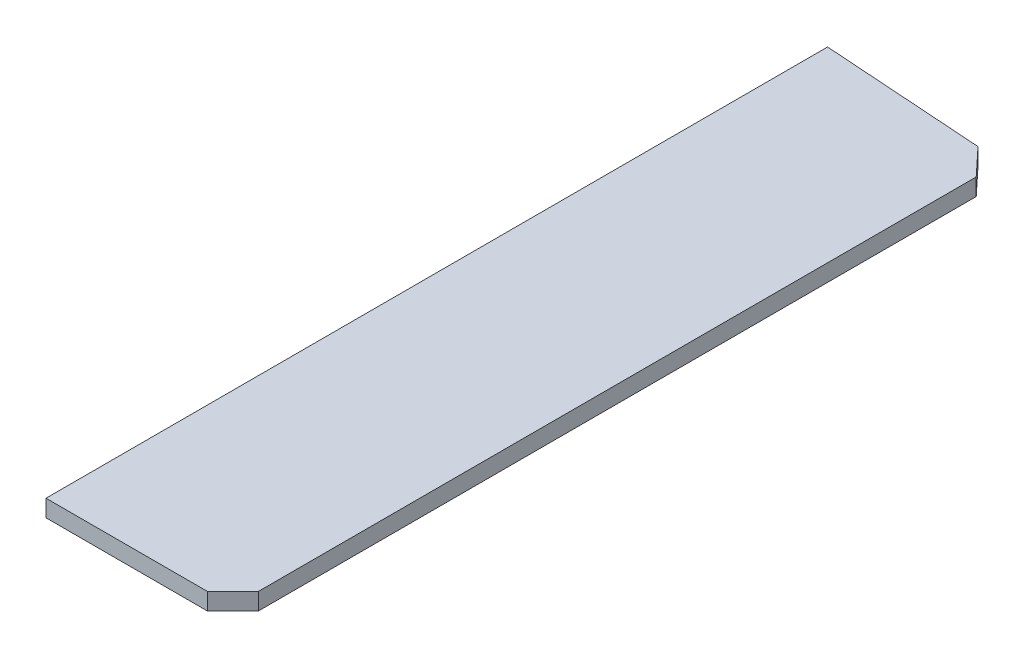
ISO-10303-21;
HEADER;
FILE_DESCRIPTION(('STEP AP214'),'2;1');
FILE_NAME('part.step','',(''),(''),'','','');
FILE_SCHEMA(('AUTOMOTIVE_DESIGN { 1 0 10303 214 1 1 1 1 }'));
ENDSEC;
DATA;
#1=APPLICATION_CONTEXT('core data for automotive mechanical design processes');
#2=APPLICATION_PROTOCOL_DEFINITION('international standard','automotive_design',2000,#1);
#3=PRODUCT_CONTEXT('',#1,'mechanical');
#4=PRODUCT('Part','Part','',(#3));
#5=PRODUCT_RELATED_PRODUCT_CATEGORY('part','',(#4));
#6=PRODUCT_DEFINITION_FORMATION('','',#4);
#7=PRODUCT_DEFINITION_CONTEXT('part definition',#1,'design');
#8=PRODUCT_DEFINITION('design','',#6,#7);
#9=PRODUCT_DEFINITION_SHAPE('','',#8);
#10=(LENGTH_UNIT() NAMED_UNIT(*) SI_UNIT(.MILLI.,.METRE.));
#11=(NAMED_UNIT(*) PLANE_ANGLE_UNIT() SI_UNIT($,.RADIAN.));
#12=(NAMED_UNIT(*) SI_UNIT($,.STERADIAN.) SOLID_ANGLE_UNIT());
#13=UNCERTAINTY_MEASURE_WITH_UNIT(LENGTH_MEASURE(1.E-05),#10,'distance_accuracy_value','');
#14=(GEOMETRIC_REPRESENTATION_CONTEXT(3) GLOBAL_UNCERTAINTY_ASSIGNED_CONTEXT((#13)) GLOBAL_UNIT_ASSIGNED_CONTEXT((#10,
#11,#12)) REPRESENTATION_CONTEXT('',''));
#15=CARTESIAN_POINT('',(0.,0.,0.));
#16=DIRECTION('',(0.,0.,1.));
#17=DIRECTION('',(1.,0.,0.));
#18=AXIS2_PLACEMENT_3D('',#15,#16,#17);
#19=CARTESIAN_POINT('',(60.3470628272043,6.34999999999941,-287.985427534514));
#20=DIRECTION('',(-0.73076120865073,0.,0.68263317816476));
#21=DIRECTION('',(0.682633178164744,0.,0.73076120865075));
#22=AXIS2_PLACEMENT_3D('',#19,#20,#21);
#23=PLANE('',#22);
#24=DIRECTION('',(-0.682633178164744,0.,-0.730761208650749));
#25=VECTOR('',#24,1.);
#26=CARTESIAN_POINT('',(60.3470628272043,0.,-287.985427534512));
#27=LINE('',#26,#25);
#28=CARTESIAN_POINT('',(69.85,0.,-277.812500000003));
#29=VERTEX_POINT('',#28);
#30=CARTESIAN_POINT('',(60.3470628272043,0.,-287.985427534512));
#31=VERTEX_POINT('',#30);
#32=EDGE_CURVE('E116',#29,#31,#27,.T.);
#33=ORIENTED_EDGE('',*,*,#32,.T.);
#34=DIRECTION('',(0.,-1.00000000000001,0.));
#35=VECTOR('',#34,1.);
#36=CARTESIAN_POINT('',(60.3470628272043,6.34999999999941,-287.985427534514));
#37=LINE('',#36,#35);
#38=CARTESIAN_POINT('',(60.3470628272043,6.34999999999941,-287.985427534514));
#39=VERTEX_POINT('',#38);
#40=EDGE_CURVE('E11',#39,#31,#37,.T.);
#41=ORIENTED_EDGE('',*,*,#40,.F.);
#42=DIRECTION('',(-0.682633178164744,0.,-0.730761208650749));
#43=VECTOR('',#42,1.);
#44=CARTESIAN_POINT('',(60.3470628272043,6.34999999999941,-287.985427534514));
#45=LINE('',#44,#43);
#46=CARTESIAN_POINT('',(69.85,6.34999999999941,-277.812500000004));
#47=VERTEX_POINT('',#46);
#48=EDGE_CURVE('E126',#47,#39,#45,.T.);
#49=ORIENTED_EDGE('',*,*,#48,.F.);
#50=DIRECTION('',(0.,-1.00000000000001,0.));
#51=VECTOR('',#50,1.);
#52=CARTESIAN_POINT('',(69.85,6.34999999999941,-277.812500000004));
#53=LINE('',#52,#51);
#54=EDGE_CURVE('E112',#47,#29,#53,.T.);
#55=ORIENTED_EDGE('',*,*,#54,.T.);
#56=EDGE_LOOP('',(#33,#41,#49,#55));
#57=FACE_BOUND('',#56,.T.);
#58=ADVANCED_FACE('F32',(#57),#23,.F.);
#59=CARTESIAN_POINT('',(-3.99680288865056E-12,6.34999999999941,-292.100000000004));
#60=DIRECTION('',(-0.0680238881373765,0.,0.99768369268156));
#61=DIRECTION('',(0.997683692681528,0.,0.0680238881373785));
#62=AXIS2_PLACEMENT_3D('',#59,#60,#61);
#63=PLANE('',#62);
#64=DIRECTION('',(-0.997683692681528,0.,-0.0680238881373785));
#65=VECTOR('',#64,1.);
#66=CARTESIAN_POINT('',(-3.99680288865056E-12,0.,-292.100000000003));
#67=LINE('',#66,#65);
#68=CARTESIAN_POINT('',(-3.99680288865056E-12,0.,-292.100000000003));
#69=VERTEX_POINT('',#68);
#70=EDGE_CURVE('E119',#31,#69,#67,.T.);
#71=ORIENTED_EDGE('',*,*,#70,.T.);
#72=DIRECTION('',(0.,-1.00000000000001,0.));
#73=VECTOR('',#72,1.);
#74=CARTESIAN_POINT('',(-3.99680288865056E-12,6.34999999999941,-292.100000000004));
#75=LINE('',#74,#73);
#76=CARTESIAN_POINT('',(-3.99680288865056E-12,6.34999999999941,-292.100000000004));
#77=VERTEX_POINT('',#76);
#78=EDGE_CURVE('E40',#77,#69,#75,.T.);
#79=ORIENTED_EDGE('',*,*,#78,.F.);
#80=DIRECTION('',(-0.997683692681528,0.,-0.0680238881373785));
#81=VECTOR('',#80,1.);
#82=CARTESIAN_POINT('',(-3.99680288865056E-12,6.34999999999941,-292.100000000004));
#83=LINE('',#82,#81);
#84=EDGE_CURVE('E85',#39,#77,#83,.T.);
#85=ORIENTED_EDGE('',*,*,#84,.F.);
#86=ORIENTED_EDGE('',*,*,#40,.T.);
#87=EDGE_LOOP('',(#71,#79,#85,#86));
#88=FACE_BOUND('',#87,.T.);
#89=ADVANCED_FACE('F150',(#88),#63,.F.);
#90=CARTESIAN_POINT('',(-3.99680288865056E-12,6.34999999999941,-292.100000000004));
#91=DIRECTION('',(0.999999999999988,0.,0.));
#92=DIRECTION('',(0.,0.,-1.00000000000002));
#93=AXIS2_PLACEMENT_3D('',#90,#91,#92);
#94=PLANE('',#93);
#95=DIRECTION('',(0.,0.,1.00000000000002));
#96=VECTOR('',#95,1.);
#97=CARTESIAN_POINT('',(-3.99680288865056E-12,0.,-292.100000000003));
#98=LINE('',#97,#96);
#99=CARTESIAN_POINT('',(0.,0.,0.));
#100=VERTEX_POINT('',#99);
#101=EDGE_CURVE('E121',#69,#100,#98,.T.);
#102=ORIENTED_EDGE('',*,*,#101,.T.);
#103=DIRECTION('',(0.,-1.00000000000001,0.));
#104=VECTOR('',#103,1.);
#105=CARTESIAN_POINT('',(0.,6.34999999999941,0.));
#106=LINE('',#105,#104);
#107=CARTESIAN_POINT('',(0.,6.34999999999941,0.));
#108=VERTEX_POINT('',#107);
#109=EDGE_CURVE('E107',#108,#100,#106,.T.);
#110=ORIENTED_EDGE('',*,*,#109,.F.);
#111=DIRECTION('',(0.,0.,1.00000000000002));
#112=VECTOR('',#111,1.);
#113=CARTESIAN_POINT('',(-3.99680288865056E-12,6.34999999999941,-292.100000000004));
#114=LINE('',#113,#112);
#115=EDGE_CURVE('E98',#77,#108,#114,.T.);
#116=ORIENTED_EDGE('',*,*,#115,.F.);
#117=ORIENTED_EDGE('',*,*,#78,.T.);
#118=EDGE_LOOP('',(#102,#110,#116,#117));
#119=FACE_BOUND('',#118,.T.);
#120=ADVANCED_FACE('F132',(#119),#94,.F.);
#121=CARTESIAN_POINT('',(0.,6.34999999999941,0.));
#122=DIRECTION('',(0.,0.,-1.00000000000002));
#123=DIRECTION('',(-0.999999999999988,0.,0.));
#124=AXIS2_PLACEMENT_3D('',#121,#122,#123);
#125=PLANE('',#124);
#126=DIRECTION('',(0.999999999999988,0.,0.));
#127=VECTOR('',#126,1.);
#128=CARTESIAN_POINT('',(0.,0.,0.));
#129=LINE('',#128,#127);
#130=CARTESIAN_POINT('',(60.325,0.,0.));
#131=VERTEX_POINT('',#130);
#132=EDGE_CURVE('E106',#100,#131,#129,.T.);
#133=ORIENTED_EDGE('',*,*,#132,.T.);
#134=DIRECTION('',(0.,-1.00000000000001,0.));
#135=VECTOR('',#134,1.);
#136=CARTESIAN_POINT('',(60.325,6.34999999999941,0.));
#137=LINE('',#136,#135);
#138=CARTESIAN_POINT('',(60.325,6.34999999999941,0.));
#139=VERTEX_POINT('',#138);
#140=EDGE_CURVE('E103',#139,#131,#137,.T.);
#141=ORIENTED_EDGE('',*,*,#140,.F.);
#142=DIRECTION('',(0.999999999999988,0.,0.));
#143=VECTOR('',#142,1.);
#144=CARTESIAN_POINT('',(0.,6.34999999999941,0.));
#145=LINE('',#144,#143);
#146=EDGE_CURVE('E92',#108,#139,#145,.T.);
#147=ORIENTED_EDGE('',*,*,#146,.F.);
#148=ORIENTED_EDGE('',*,*,#109,.T.);
#149=EDGE_LOOP('',(#133,#141,#147,#148));
#150=FACE_BOUND('',#149,.T.);
#151=ADVANCED_FACE('F104',(#150),#125,.F.);
#152=CARTESIAN_POINT('',(60.325,6.34999999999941,0.));
#153=DIRECTION('',(-0.70710678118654,0.,-0.707106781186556));
#154=DIRECTION('',(-0.70710678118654,0.,0.707106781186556));
#155=AXIS2_PLACEMENT_3D('',#152,#153,#154);
#156=PLANE('',#155);
#157=DIRECTION('',(0.70710678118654,0.,-0.707106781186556));
#158=VECTOR('',#157,1.);
#159=CARTESIAN_POINT('',(60.325,0.,0.));
#160=LINE('',#159,#158);
#161=CARTESIAN_POINT('',(69.850000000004,0.,-9.52500000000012));
#162=VERTEX_POINT('',#161);
#163=EDGE_CURVE('E71',#131,#162,#160,.T.);
#164=ORIENTED_EDGE('',*,*,#163,.T.);
#165=DIRECTION('',(0.,-1.00000000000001,0.));
#166=VECTOR('',#165,1.);
#167=CARTESIAN_POINT('',(69.850000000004,6.34999999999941,-9.52500000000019));
#168=LINE('',#167,#166);
#169=CARTESIAN_POINT('',(69.850000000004,6.34999999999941,-9.52500000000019));
#170=VERTEX_POINT('',#169);
#171=EDGE_CURVE('E108',#170,#162,#168,.T.);
#172=ORIENTED_EDGE('',*,*,#171,.F.);
#173=DIRECTION('',(0.70710678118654,0.,-0.707106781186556));
#174=VECTOR('',#173,1.);
#175=CARTESIAN_POINT('',(60.325,6.34999999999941,0.));
#176=LINE('',#175,#174);
#177=EDGE_CURVE('E96',#139,#170,#176,.T.);
#178=ORIENTED_EDGE('',*,*,#177,.F.);
#179=ORIENTED_EDGE('',*,*,#140,.T.);
#180=EDGE_LOOP('',(#164,#172,#178,#179));
#181=FACE_BOUND('',#180,.T.);
#182=ADVANCED_FACE('F110',(#181),#156,.F.);
#183=CARTESIAN_POINT('',(69.85,6.34999999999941,-277.812500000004));
#184=DIRECTION('',(-0.999999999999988,0.,0.));
#185=DIRECTION('',(0.,0.,1.00000000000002));
#186=AXIS2_PLACEMENT_3D('',#183,#184,#185);
#187=PLANE('',#186);
#188=DIRECTION('',(0.,0.,-1.00000000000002));
#189=VECTOR('',#188,1.);
#190=CARTESIAN_POINT('',(69.85,0.,-277.812500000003));
#191=LINE('',#190,#189);
#192=EDGE_CURVE('E77',#162,#29,#191,.T.);
#193=ORIENTED_EDGE('',*,*,#192,.T.);
#194=ORIENTED_EDGE('',*,*,#54,.F.);
#195=DIRECTION('',(0.,0.,-1.00000000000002));
#196=VECTOR('',#195,1.);
#197=CARTESIAN_POINT('',(69.85,6.34999999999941,-277.812500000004));
#198=LINE('',#197,#196);
#199=EDGE_CURVE('E48',#170,#47,#198,.T.);
#200=ORIENTED_EDGE('',*,*,#199,.F.);
#201=ORIENTED_EDGE('',*,*,#171,.T.);
#202=EDGE_LOOP('',(#193,#194,#200,#201));
#203=FACE_BOUND('',#202,.T.);
#204=ADVANCED_FACE('F139',(#203),#187,.F.);
#205=CARTESIAN_POINT('',(199.425970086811,6.34999999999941,-139.100970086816));
#206=DIRECTION('',(0.,1.00000000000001,0.));
#207=DIRECTION('',(0.,0.,1.00000000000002));
#208=AXIS2_PLACEMENT_3D('',#205,#206,#207);
#209=PLANE('',#208);
#210=ORIENTED_EDGE('',*,*,#48,.T.);
#211=ORIENTED_EDGE('',*,*,#84,.T.);
#212=ORIENTED_EDGE('',*,*,#115,.T.);
#213=ORIENTED_EDGE('',*,*,#146,.T.);
#214=ORIENTED_EDGE('',*,*,#177,.T.);
#215=ORIENTED_EDGE('',*,*,#199,.T.);
#216=EDGE_LOOP('',(#210,#211,#212,#213,#214,#215));
#217=FACE_BOUND('',#216,.T.);
#218=ADVANCED_FACE('F94',(#217),#209,.T.);
#219=CARTESIAN_POINT('',(199.425970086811,0.,-139.100970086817));
#220=DIRECTION('',(0.,1.00000000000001,0.));
#221=DIRECTION('',(0.,0.,1.00000000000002));
#222=AXIS2_PLACEMENT_3D('',#219,#220,#221);
#223=PLANE('',#222);
#224=ORIENTED_EDGE('',*,*,#32,.F.);
#225=ORIENTED_EDGE('',*,*,#192,.F.);
#226=ORIENTED_EDGE('',*,*,#163,.F.);
#227=ORIENTED_EDGE('',*,*,#132,.F.);
#228=ORIENTED_EDGE('',*,*,#101,.F.);
#229=ORIENTED_EDGE('',*,*,#70,.F.);
#230=EDGE_LOOP('',(#224,#225,#226,#227,#228,#229));
#231=FACE_BOUND('',#230,.T.);
#232=ADVANCED_FACE('F135',(#231),#223,.F.);
#233=CLOSED_SHELL('',(#58,#89,#120,#151,#182,#204,#218,#232));
#234=MANIFOLD_SOLID_BREP('B2',#233);
#235=ADVANCED_BREP_SHAPE_REPRESENTATION('',(#18,#234),#14);
#236=SHAPE_DEFINITION_REPRESENTATION(#9,#235);
ENDSEC;
END-ISO-10303-21;
